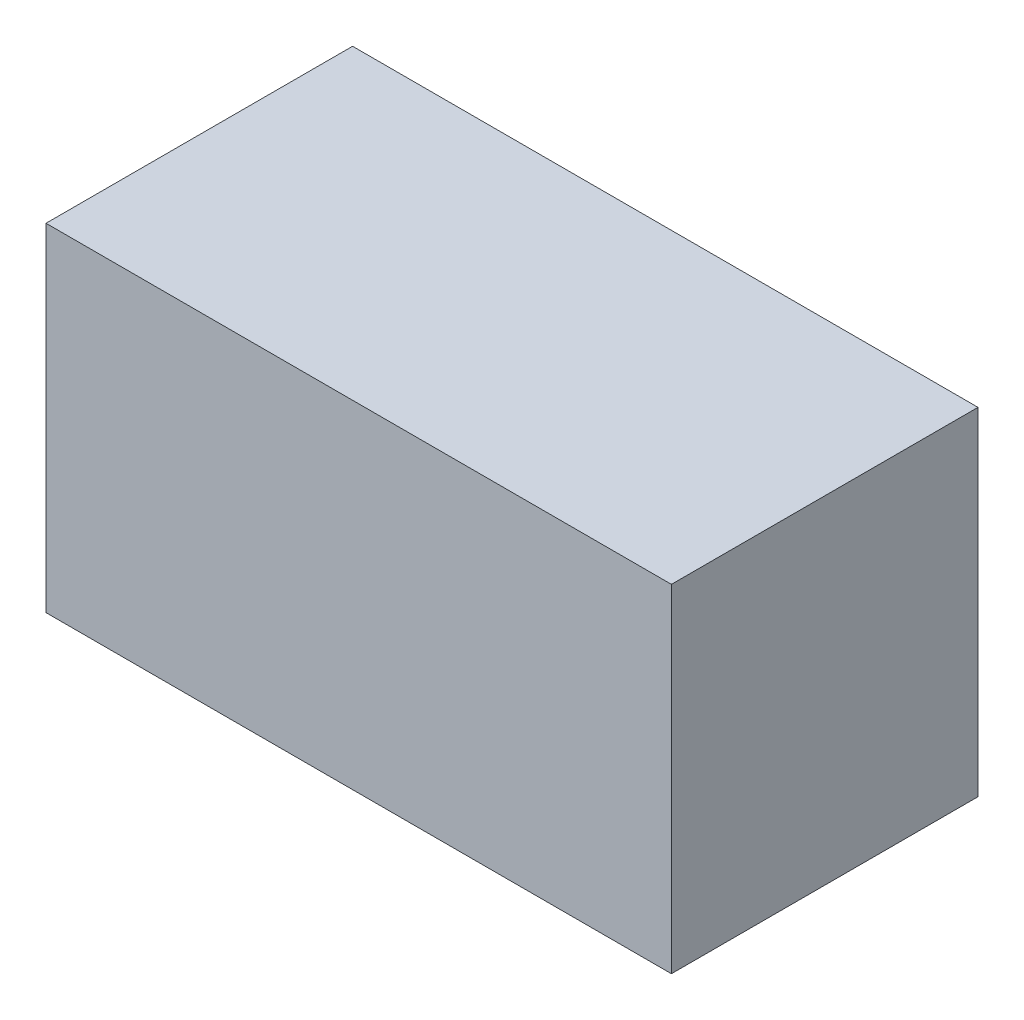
ISO-10303-21;
HEADER;
FILE_DESCRIPTION(('STEP AP214'),'2;1');
FILE_NAME('part.step','',(''),(''),'','','');
FILE_SCHEMA(('AUTOMOTIVE_DESIGN { 1 0 10303 214 1 1 1 1 }'));
ENDSEC;
DATA;
#1=APPLICATION_CONTEXT('core data for automotive mechanical design processes');
#2=APPLICATION_PROTOCOL_DEFINITION('international standard','automotive_design',2000,#1);
#3=PRODUCT_CONTEXT('',#1,'mechanical');
#4=PRODUCT('Part','Part','',(#3));
#5=PRODUCT_RELATED_PRODUCT_CATEGORY('part','',(#4));
#6=PRODUCT_DEFINITION_FORMATION('','',#4);
#7=PRODUCT_DEFINITION_CONTEXT('part definition',#1,'design');
#8=PRODUCT_DEFINITION('design','',#6,#7);
#9=PRODUCT_DEFINITION_SHAPE('','',#8);
#10=(LENGTH_UNIT() NAMED_UNIT(*) SI_UNIT(.MILLI.,.METRE.));
#11=(NAMED_UNIT(*) PLANE_ANGLE_UNIT() SI_UNIT($,.RADIAN.));
#12=(NAMED_UNIT(*) SI_UNIT($,.STERADIAN.) SOLID_ANGLE_UNIT());
#13=UNCERTAINTY_MEASURE_WITH_UNIT(LENGTH_MEASURE(1.E-05),#10,'distance_accuracy_value','');
#14=(GEOMETRIC_REPRESENTATION_CONTEXT(3) GLOBAL_UNCERTAINTY_ASSIGNED_CONTEXT((#13)) GLOBAL_UNIT_ASSIGNED_CONTEXT((#10,
#11,#12)) REPRESENTATION_CONTEXT('',''));
#15=CARTESIAN_POINT('',(0.,0.,0.));
#16=DIRECTION('',(0.,0.,1.));
#17=DIRECTION('',(1.,0.,0.));
#18=AXIS2_PLACEMENT_3D('',#15,#16,#17);
#19=CARTESIAN_POINT('',(0.,5.5,0.));
#20=DIRECTION('',(1.,0.,0.));
#21=DIRECTION('',(0.,0.,-1.));
#22=AXIS2_PLACEMENT_3D('',#19,#20,#21);
#23=PLANE('',#22);
#24=DIRECTION('',(0.,0.,1.));
#25=VECTOR('',#24,1.);
#26=CARTESIAN_POINT('',(0.,0.,0.));
#27=LINE('',#26,#25);
#28=CARTESIAN_POINT('',(0.,0.,-5.));
#29=VERTEX_POINT('',#28);
#30=CARTESIAN_POINT('',(0.,0.,0.));
#31=VERTEX_POINT('',#30);
#32=EDGE_CURVE('E102',#29,#31,#27,.T.);
#33=ORIENTED_EDGE('',*,*,#32,.T.);
#34=DIRECTION('',(0.,-1.,0.));
#35=VECTOR('',#34,1.);
#36=CARTESIAN_POINT('',(0.,5.5,0.));
#37=LINE('',#36,#35);
#38=CARTESIAN_POINT('',(0.,5.5,0.));
#39=VERTEX_POINT('',#38);
#40=EDGE_CURVE('E11',#39,#31,#37,.T.);
#41=ORIENTED_EDGE('',*,*,#40,.F.);
#42=DIRECTION('',(0.,0.,1.));
#43=VECTOR('',#42,1.);
#44=CARTESIAN_POINT('',(0.,5.5,0.));
#45=LINE('',#44,#43);
#46=CARTESIAN_POINT('',(0.,5.5,-5.));
#47=VERTEX_POINT('',#46);
#48=EDGE_CURVE('E90',#47,#39,#45,.T.);
#49=ORIENTED_EDGE('',*,*,#48,.F.);
#50=DIRECTION('',(0.,-1.,0.));
#51=VECTOR('',#50,1.);
#52=CARTESIAN_POINT('',(0.,5.5,-5.));
#53=LINE('',#52,#51);
#54=EDGE_CURVE('E98',#47,#29,#53,.T.);
#55=ORIENTED_EDGE('',*,*,#54,.T.);
#56=EDGE_LOOP('',(#33,#41,#49,#55));
#57=FACE_BOUND('',#56,.T.);
#58=ADVANCED_FACE('F39',(#57),#23,.F.);
#59=CARTESIAN_POINT('',(0.,5.5,0.));
#60=DIRECTION('',(0.,0.,-1.));
#61=DIRECTION('',(-1.,0.,0.));
#62=AXIS2_PLACEMENT_3D('',#59,#60,#61);
#63=PLANE('',#62);
#64=DIRECTION('',(1.,0.,0.));
#65=VECTOR('',#64,1.);
#66=CARTESIAN_POINT('',(0.,0.,0.));
#67=LINE('',#66,#65);
#68=CARTESIAN_POINT('',(10.2,0.,0.));
#69=VERTEX_POINT('',#68);
#70=EDGE_CURVE('E94',#31,#69,#67,.T.);
#71=ORIENTED_EDGE('',*,*,#70,.T.);
#72=DIRECTION('',(0.,-1.,0.));
#73=VECTOR('',#72,1.);
#74=CARTESIAN_POINT('',(10.2,5.5,0.));
#75=LINE('',#74,#73);
#76=CARTESIAN_POINT('',(10.2,5.5,0.));
#77=VERTEX_POINT('',#76);
#78=EDGE_CURVE('E47',#77,#69,#75,.T.);
#79=ORIENTED_EDGE('',*,*,#78,.F.);
#80=DIRECTION('',(1.,0.,0.));
#81=VECTOR('',#80,1.);
#82=CARTESIAN_POINT('',(0.,5.5,0.));
#83=LINE('',#82,#81);
#84=EDGE_CURVE('E85',#39,#77,#83,.T.);
#85=ORIENTED_EDGE('',*,*,#84,.F.);
#86=ORIENTED_EDGE('',*,*,#40,.T.);
#87=EDGE_LOOP('',(#71,#79,#85,#86));
#88=FACE_BOUND('',#87,.T.);
#89=ADVANCED_FACE('F93',(#88),#63,.F.);
#90=CARTESIAN_POINT('',(10.2,5.5,0.));
#91=DIRECTION('',(-1.,0.,0.));
#92=DIRECTION('',(0.,0.,1.));
#93=AXIS2_PLACEMENT_3D('',#90,#91,#92);
#94=PLANE('',#93);
#95=DIRECTION('',(0.,0.,-1.));
#96=VECTOR('',#95,1.);
#97=CARTESIAN_POINT('',(10.2,0.,0.));
#98=LINE('',#97,#96);
#99=CARTESIAN_POINT('',(10.2,0.,-5.));
#100=VERTEX_POINT('',#99);
#101=EDGE_CURVE('E72',#69,#100,#98,.T.);
#102=ORIENTED_EDGE('',*,*,#101,.T.);
#103=DIRECTION('',(0.,-1.,0.));
#104=VECTOR('',#103,1.);
#105=CARTESIAN_POINT('',(10.2,5.5,-5.));
#106=LINE('',#105,#104);
#107=CARTESIAN_POINT('',(10.2,5.5,-5.));
#108=VERTEX_POINT('',#107);
#109=EDGE_CURVE('E95',#108,#100,#106,.T.);
#110=ORIENTED_EDGE('',*,*,#109,.F.);
#111=DIRECTION('',(0.,0.,-1.));
#112=VECTOR('',#111,1.);
#113=CARTESIAN_POINT('',(10.2,5.5,0.));
#114=LINE('',#113,#112);
#115=EDGE_CURVE('E88',#77,#108,#114,.T.);
#116=ORIENTED_EDGE('',*,*,#115,.F.);
#117=ORIENTED_EDGE('',*,*,#78,.T.);
#118=EDGE_LOOP('',(#102,#110,#116,#117));
#119=FACE_BOUND('',#118,.T.);
#120=ADVANCED_FACE('F96',(#119),#94,.F.);
#121=CARTESIAN_POINT('',(0.,5.5,-5.));
#122=DIRECTION('',(0.,0.,1.));
#123=DIRECTION('',(1.,0.,0.));
#124=AXIS2_PLACEMENT_3D('',#121,#122,#123);
#125=PLANE('',#124);
#126=DIRECTION('',(-1.,0.,0.));
#127=VECTOR('',#126,1.);
#128=CARTESIAN_POINT('',(0.,0.,-5.));
#129=LINE('',#128,#127);
#130=EDGE_CURVE('E78',#100,#29,#129,.T.);
#131=ORIENTED_EDGE('',*,*,#130,.T.);
#132=ORIENTED_EDGE('',*,*,#54,.F.);
#133=DIRECTION('',(-1.,0.,0.));
#134=VECTOR('',#133,1.);
#135=CARTESIAN_POINT('',(0.,5.5,-5.));
#136=LINE('',#135,#134);
#137=EDGE_CURVE('E55',#108,#47,#136,.T.);
#138=ORIENTED_EDGE('',*,*,#137,.F.);
#139=ORIENTED_EDGE('',*,*,#109,.T.);
#140=EDGE_LOOP('',(#131,#132,#138,#139));
#141=FACE_BOUND('',#140,.T.);
#142=ADVANCED_FACE('F110',(#141),#125,.F.);
#143=CARTESIAN_POINT('',(0.,5.5,0.));
#144=DIRECTION('',(0.,-1.,0.));
#145=DIRECTION('',(0.,0.,-1.));
#146=AXIS2_PLACEMENT_3D('',#143,#144,#145);
#147=PLANE('',#146);
#148=ORIENTED_EDGE('',*,*,#48,.T.);
#149=ORIENTED_EDGE('',*,*,#84,.T.);
#150=ORIENTED_EDGE('',*,*,#115,.T.);
#151=ORIENTED_EDGE('',*,*,#137,.T.);
#152=EDGE_LOOP('',(#148,#149,#150,#151));
#153=FACE_BOUND('',#152,.T.);
#154=ADVANCED_FACE('F86',(#153),#147,.F.);
#155=CARTESIAN_POINT('',(0.,0.,0.));
#156=DIRECTION('',(0.,-1.,0.));
#157=DIRECTION('',(0.,0.,-1.));
#158=AXIS2_PLACEMENT_3D('',#155,#156,#157);
#159=PLANE('',#158);
#160=CARTESIAN_POINT('',(8.2,0.,-2.5));
#161=DIRECTION('',(0.,1.,0.));
#162=DIRECTION('',(0.,0.,1.));
#163=AXIS2_PLACEMENT_3D('',#160,#161,#162);
#164=CIRCLE('',#163,1.5);
#165=CARTESIAN_POINT('',(8.2,0.,-0.999999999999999));
#166=VERTEX_POINT('',#165);
#167=EDGE_CURVE('E128',#166,#166,#164,.T.);
#168=ORIENTED_EDGE('',*,*,#167,.T.);
#169=EDGE_LOOP('',(#168));
#170=FACE_BOUND('',#169,.T.);
#171=CARTESIAN_POINT('',(5.1,0.,-2.5));
#172=DIRECTION('',(0.,1.,0.));
#173=DIRECTION('',(0.,0.,1.));
#174=AXIS2_PLACEMENT_3D('',#171,#172,#173);
#175=CIRCLE('',#174,1.5);
#176=CARTESIAN_POINT('',(5.1,0.,-1.));
#177=VERTEX_POINT('',#176);
#178=EDGE_CURVE('E122',#177,#177,#175,.T.);
#179=ORIENTED_EDGE('',*,*,#178,.T.);
#180=EDGE_LOOP('',(#179));
#181=FACE_BOUND('',#180,.T.);
#182=CARTESIAN_POINT('',(2.,0.,-2.5));
#183=DIRECTION('',(0.,1.,0.));
#184=DIRECTION('',(0.,0.,1.));
#185=AXIS2_PLACEMENT_3D('',#182,#183,#184);
#186=CIRCLE('',#185,1.5);
#187=CARTESIAN_POINT('',(2.,0.,-0.999999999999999));
#188=VERTEX_POINT('',#187);
#189=EDGE_CURVE('E116',#188,#188,#186,.T.);
#190=ORIENTED_EDGE('',*,*,#189,.T.);
#191=EDGE_LOOP('',(#190));
#192=FACE_BOUND('',#191,.T.);
#193=ORIENTED_EDGE('',*,*,#32,.F.);
#194=ORIENTED_EDGE('',*,*,#130,.F.);
#195=ORIENTED_EDGE('',*,*,#101,.F.);
#196=ORIENTED_EDGE('',*,*,#70,.F.);
#197=EDGE_LOOP('',(#193,#194,#195,#196));
#198=FACE_BOUND('',#197,.T.);
#199=ADVANCED_FACE('F113',(#170,#181,#192,#198),#159,.T.);
#200=CARTESIAN_POINT('',(2.,2.,-2.5));
#201=DIRECTION('',(0.,-1.,0.));
#202=DIRECTION('',(0.,0.,-1.));
#203=AXIS2_PLACEMENT_3D('',#200,#201,#202);
#204=CYLINDRICAL_SURFACE('',#203,1.5);
#205=CARTESIAN_POINT('',(2.,2.,-2.5));
#206=DIRECTION('',(0.,1.,0.));
#207=DIRECTION('',(0.,0.,1.));
#208=AXIS2_PLACEMENT_3D('',#205,#206,#207);
#209=CIRCLE('',#208,1.5);
#210=CARTESIAN_POINT('',(2.,2.,-0.999999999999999));
#211=VERTEX_POINT('',#210);
#212=EDGE_CURVE('E105',#211,#211,#209,.T.);
#213=ORIENTED_EDGE('',*,*,#212,.T.);
#214=EDGE_LOOP('',(#213));
#215=FACE_BOUND('',#214,.T.);
#216=ORIENTED_EDGE('',*,*,#189,.F.);
#217=EDGE_LOOP('',(#216));
#218=FACE_BOUND('',#217,.T.);
#219=ADVANCED_FACE('F158',(#215,#218),#204,.F.);
#220=CARTESIAN_POINT('',(2.,2.,-2.5));
#221=DIRECTION('',(0.,1.,0.));
#222=DIRECTION('',(0.,0.,1.));
#223=AXIS2_PLACEMENT_3D('',#220,#221,#222);
#224=PLANE('',#223);
#225=ORIENTED_EDGE('',*,*,#212,.F.);
#226=EDGE_LOOP('',(#225));
#227=FACE_BOUND('',#226,.T.);
#228=ADVANCED_FACE('F164',(#227),#224,.F.);
#229=CARTESIAN_POINT('',(5.1,3.2,-2.5));
#230=DIRECTION('',(0.,-1.,0.));
#231=DIRECTION('',(0.,0.,-1.));
#232=AXIS2_PLACEMENT_3D('',#229,#230,#231);
#233=CYLINDRICAL_SURFACE('',#232,1.5);
#234=CARTESIAN_POINT('',(5.1,3.2,-2.5));
#235=DIRECTION('',(0.,1.,0.));
#236=DIRECTION('',(0.,0.,1.));
#237=AXIS2_PLACEMENT_3D('',#234,#235,#236);
#238=CIRCLE('',#237,1.5);
#239=CARTESIAN_POINT('',(5.1,3.2,-1.));
#240=VERTEX_POINT('',#239);
#241=EDGE_CURVE('E119',#240,#240,#238,.T.);
#242=ORIENTED_EDGE('',*,*,#241,.T.);
#243=EDGE_LOOP('',(#242));
#244=FACE_BOUND('',#243,.T.);
#245=ORIENTED_EDGE('',*,*,#178,.F.);
#246=EDGE_LOOP('',(#245));
#247=FACE_BOUND('',#246,.T.);
#248=ADVANCED_FACE('F168',(#244,#247),#233,.F.);
#249=CARTESIAN_POINT('',(5.1,3.2,-2.5));
#250=DIRECTION('',(0.,1.,0.));
#251=DIRECTION('',(0.,0.,1.));
#252=AXIS2_PLACEMENT_3D('',#249,#250,#251);
#253=PLANE('',#252);
#254=ORIENTED_EDGE('',*,*,#241,.F.);
#255=EDGE_LOOP('',(#254));
#256=FACE_BOUND('',#255,.T.);
#257=ADVANCED_FACE('F143',(#256),#253,.F.);
#258=CARTESIAN_POINT('',(8.2,4.8,-2.5));
#259=DIRECTION('',(0.,-1.,0.));
#260=DIRECTION('',(0.,0.,-1.));
#261=AXIS2_PLACEMENT_3D('',#258,#259,#260);
#262=CYLINDRICAL_SURFACE('',#261,1.5);
#263=CARTESIAN_POINT('',(8.2,4.8,-2.5));
#264=DIRECTION('',(0.,1.,0.));
#265=DIRECTION('',(0.,0.,1.));
#266=AXIS2_PLACEMENT_3D('',#263,#264,#265);
#267=CIRCLE('',#266,1.5);
#268=CARTESIAN_POINT('',(8.2,4.8,-0.999999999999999));
#269=VERTEX_POINT('',#268);
#270=EDGE_CURVE('E125',#269,#269,#267,.T.);
#271=ORIENTED_EDGE('',*,*,#270,.T.);
#272=EDGE_LOOP('',(#271));
#273=FACE_BOUND('',#272,.T.);
#274=ORIENTED_EDGE('',*,*,#167,.F.);
#275=EDGE_LOOP('',(#274));
#276=FACE_BOUND('',#275,.T.);
#277=ADVANCED_FACE('F134',(#273,#276),#262,.F.);
#278=CARTESIAN_POINT('',(8.2,4.8,-2.5));
#279=DIRECTION('',(0.,1.,0.));
#280=DIRECTION('',(0.,0.,1.));
#281=AXIS2_PLACEMENT_3D('',#278,#279,#280);
#282=PLANE('',#281);
#283=ORIENTED_EDGE('',*,*,#270,.F.);
#284=EDGE_LOOP('',(#283));
#285=FACE_BOUND('',#284,.T.);
#286=ADVANCED_FACE('F137',(#285),#282,.F.);
#287=CLOSED_SHELL('',(#58,#89,#120,#142,#154,#199,#219,#228,#248,#257,#277,#286));
#288=MANIFOLD_SOLID_BREP('B2',#287);
#289=ADVANCED_BREP_SHAPE_REPRESENTATION('',(#18,#288),#14);
#290=SHAPE_DEFINITION_REPRESENTATION(#9,#289);
ENDSEC;
END-ISO-10303-21;
